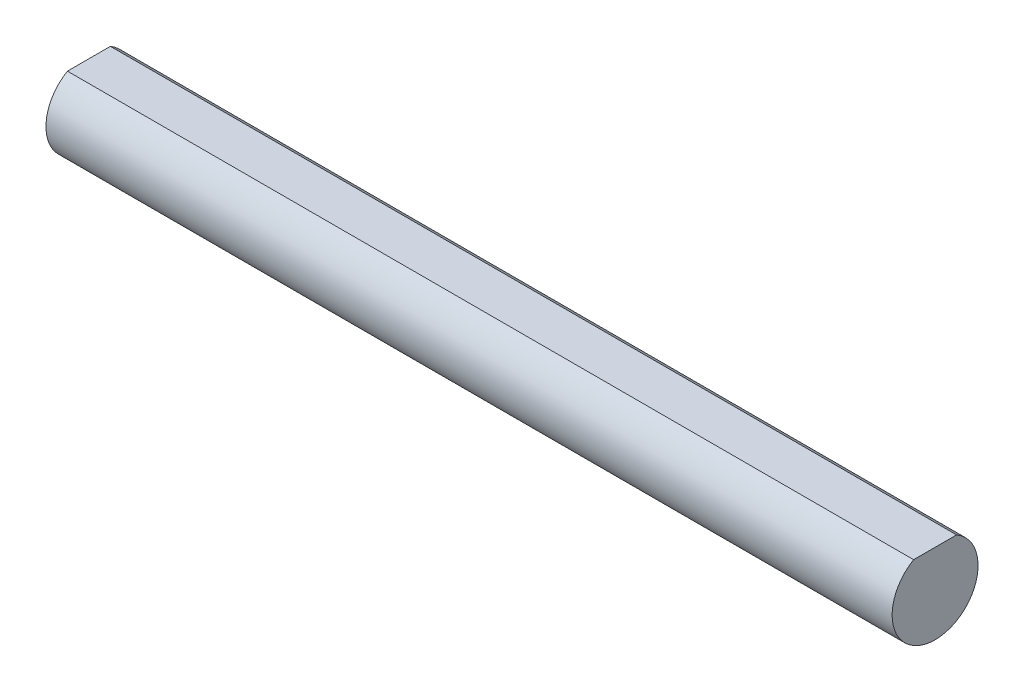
ISO-10303-21;
HEADER;
FILE_DESCRIPTION(('STEP AP214'),'2;1');
FILE_NAME('part.step','',(''),(''),'','','');
FILE_SCHEMA(('AUTOMOTIVE_DESIGN { 1 0 10303 214 1 1 1 1 }'));
ENDSEC;
DATA;
#1=APPLICATION_CONTEXT('core data for automotive mechanical design processes');
#2=APPLICATION_PROTOCOL_DEFINITION('international standard','automotive_design',2000,#1);
#3=PRODUCT_CONTEXT('',#1,'mechanical');
#4=PRODUCT('Part','Part','',(#3));
#5=PRODUCT_RELATED_PRODUCT_CATEGORY('part','',(#4));
#6=PRODUCT_DEFINITION_FORMATION('','',#4);
#7=PRODUCT_DEFINITION_CONTEXT('part definition',#1,'design');
#8=PRODUCT_DEFINITION('design','',#6,#7);
#9=PRODUCT_DEFINITION_SHAPE('','',#8);
#10=(LENGTH_UNIT() NAMED_UNIT(*) SI_UNIT(.MILLI.,.METRE.));
#11=(NAMED_UNIT(*) PLANE_ANGLE_UNIT() SI_UNIT($,.RADIAN.));
#12=(NAMED_UNIT(*) SI_UNIT($,.STERADIAN.) SOLID_ANGLE_UNIT());
#13=UNCERTAINTY_MEASURE_WITH_UNIT(LENGTH_MEASURE(1.E-05),#10,'distance_accuracy_value','');
#14=(GEOMETRIC_REPRESENTATION_CONTEXT(3) GLOBAL_UNCERTAINTY_ASSIGNED_CONTEXT((#13)) GLOBAL_UNIT_ASSIGNED_CONTEXT((#10,
#11,#12)) REPRESENTATION_CONTEXT('',''));
#15=CARTESIAN_POINT('',(0.,0.,0.));
#16=DIRECTION('',(0.,0.,1.));
#17=DIRECTION('',(1.,0.,0.));
#18=AXIS2_PLACEMENT_3D('',#15,#16,#17);
#19=CARTESIAN_POINT('',(59.1,0.,0.));
#20=DIRECTION('',(-1.,0.,0.));
#21=DIRECTION('',(0.,0.,1.));
#22=AXIS2_PLACEMENT_3D('',#19,#20,#21);
#23=CYLINDRICAL_SURFACE('',#22,3.);
#24=CARTESIAN_POINT('',(0.,0.,0.));
#25=DIRECTION('',(1.,0.,0.));
#26=DIRECTION('',(0.,0.,-1.));
#27=AXIS2_PLACEMENT_3D('',#24,#25,#26);
#28=CIRCLE('',#27,3.);
#29=CARTESIAN_POINT('',(0.,2.59807621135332,1.5));
#30=VERTEX_POINT('',#29);
#31=CARTESIAN_POINT('',(0.,2.59807621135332,-1.5));
#32=VERTEX_POINT('',#31);
#33=EDGE_CURVE('E69',#30,#32,#28,.T.);
#34=ORIENTED_EDGE('',*,*,#33,.T.);
#35=DIRECTION('',(-1.,0.,0.));
#36=VECTOR('',#35,1.);
#37=CARTESIAN_POINT('',(59.1,2.59807621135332,-1.5));
#38=LINE('',#37,#36);
#39=CARTESIAN_POINT('',(59.1,2.59807621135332,-1.5));
#40=VERTEX_POINT('',#39);
#41=EDGE_CURVE('E11',#40,#32,#38,.T.);
#42=ORIENTED_EDGE('',*,*,#41,.F.);
#43=CARTESIAN_POINT('',(59.1,0.,0.));
#44=DIRECTION('',(1.,0.,0.));
#45=DIRECTION('',(0.,0.,-1.));
#46=AXIS2_PLACEMENT_3D('',#43,#44,#45);
#47=CIRCLE('',#46,3.);
#48=CARTESIAN_POINT('',(59.1,2.59807621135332,1.5));
#49=VERTEX_POINT('',#48);
#50=EDGE_CURVE('E68',#49,#40,#47,.T.);
#51=ORIENTED_EDGE('',*,*,#50,.F.);
#52=DIRECTION('',(-1.,0.,0.));
#53=VECTOR('',#52,1.);
#54=CARTESIAN_POINT('',(59.1,2.59807621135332,1.5));
#55=LINE('',#54,#53);
#56=EDGE_CURVE('E46',#49,#30,#55,.T.);
#57=ORIENTED_EDGE('',*,*,#56,.T.);
#58=EDGE_LOOP('',(#34,#42,#51,#57));
#59=FACE_BOUND('',#58,.T.);
#60=ADVANCED_FACE('F38',(#59),#23,.T.);
#61=CARTESIAN_POINT('',(59.1,2.59807621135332,-1.5));
#62=DIRECTION('',(0.,-1.,0.));
#63=DIRECTION('',(0.,0.,-1.));
#64=AXIS2_PLACEMENT_3D('',#61,#62,#63);
#65=PLANE('',#64);
#66=DIRECTION('',(0.,0.,1.));
#67=VECTOR('',#66,1.);
#68=CARTESIAN_POINT('',(0.,2.59807621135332,-1.5));
#69=LINE('',#68,#67);
#70=EDGE_CURVE('E61',#32,#30,#69,.T.);
#71=ORIENTED_EDGE('',*,*,#70,.T.);
#72=ORIENTED_EDGE('',*,*,#56,.F.);
#73=DIRECTION('',(0.,0.,1.));
#74=VECTOR('',#73,1.);
#75=CARTESIAN_POINT('',(59.1,2.59807621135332,-1.5));
#76=LINE('',#75,#74);
#77=EDGE_CURVE('E53',#40,#49,#76,.T.);
#78=ORIENTED_EDGE('',*,*,#77,.F.);
#79=ORIENTED_EDGE('',*,*,#41,.T.);
#80=EDGE_LOOP('',(#71,#72,#78,#79));
#81=FACE_BOUND('',#80,.T.);
#82=ADVANCED_FACE('F64',(#81),#65,.F.);
#83=CARTESIAN_POINT('',(59.1,0.,0.));
#84=DIRECTION('',(1.,0.,0.));
#85=DIRECTION('',(0.,0.,-1.));
#86=AXIS2_PLACEMENT_3D('',#83,#84,#85);
#87=PLANE('',#86);
#88=ORIENTED_EDGE('',*,*,#50,.T.);
#89=ORIENTED_EDGE('',*,*,#77,.T.);
#90=EDGE_LOOP('',(#88,#89));
#91=FACE_BOUND('',#90,.T.);
#92=ADVANCED_FACE('F76',(#91),#87,.T.);
#93=CARTESIAN_POINT('',(0.,0.,0.));
#94=DIRECTION('',(1.,0.,0.));
#95=DIRECTION('',(0.,0.,-1.));
#96=AXIS2_PLACEMENT_3D('',#93,#94,#95);
#97=PLANE('',#96);
#98=ORIENTED_EDGE('',*,*,#33,.F.);
#99=ORIENTED_EDGE('',*,*,#70,.F.);
#100=EDGE_LOOP('',(#98,#99));
#101=FACE_BOUND('',#100,.T.);
#102=ADVANCED_FACE('F72',(#101),#97,.F.);
#103=CLOSED_SHELL('',(#60,#82,#92,#102));
#104=MANIFOLD_SOLID_BREP('B2',#103);
#105=ADVANCED_BREP_SHAPE_REPRESENTATION('',(#18,#104),#14);
#106=SHAPE_DEFINITION_REPRESENTATION(#9,#105);
ENDSEC;
END-ISO-10303-21;
